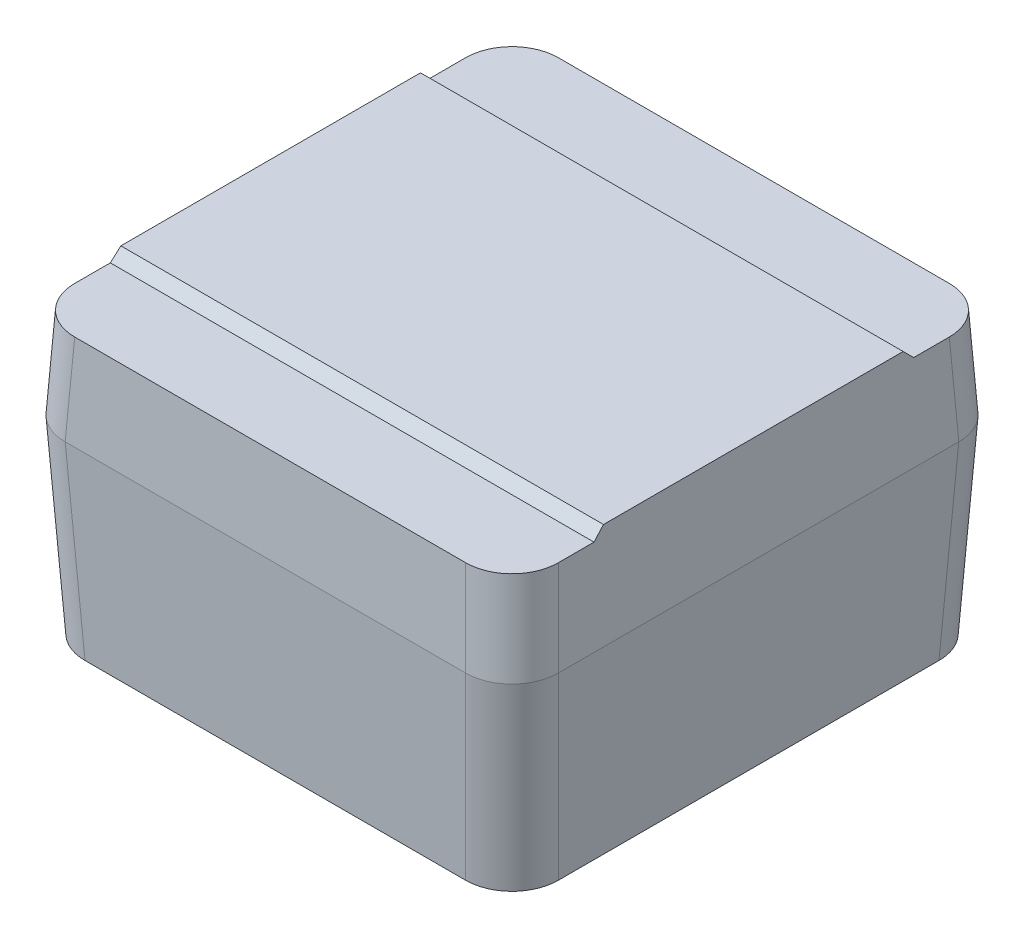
ISO-10303-21;
HEADER;
FILE_DESCRIPTION(('STEP AP214'),'2;1');
FILE_NAME('part.step','',(''),(''),'','','');
FILE_SCHEMA(('AUTOMOTIVE_DESIGN { 1 0 10303 214 1 1 1 1 }'));
ENDSEC;
DATA;
#1=APPLICATION_CONTEXT('core data for automotive mechanical design processes');
#2=APPLICATION_PROTOCOL_DEFINITION('international standard','automotive_design',2000,#1);
#3=PRODUCT_CONTEXT('',#1,'mechanical');
#4=PRODUCT('Part','Part','',(#3));
#5=PRODUCT_RELATED_PRODUCT_CATEGORY('part','',(#4));
#6=PRODUCT_DEFINITION_FORMATION('','',#4);
#7=PRODUCT_DEFINITION_CONTEXT('part definition',#1,'design');
#8=PRODUCT_DEFINITION('design','',#6,#7);
#9=PRODUCT_DEFINITION_SHAPE('','',#8);
#10=(LENGTH_UNIT() NAMED_UNIT(*) SI_UNIT(.MILLI.,.METRE.));
#11=(NAMED_UNIT(*) PLANE_ANGLE_UNIT() SI_UNIT($,.RADIAN.));
#12=(NAMED_UNIT(*) SI_UNIT($,.STERADIAN.) SOLID_ANGLE_UNIT());
#13=UNCERTAINTY_MEASURE_WITH_UNIT(LENGTH_MEASURE(1.E-05),#10,'distance_accuracy_value','');
#14=(GEOMETRIC_REPRESENTATION_CONTEXT(3) GLOBAL_UNCERTAINTY_ASSIGNED_CONTEXT((#13)) GLOBAL_UNIT_ASSIGNED_CONTEXT((#10,
#11,#12)) REPRESENTATION_CONTEXT('',''));
#15=CARTESIAN_POINT('',(0.,0.,0.));
#16=DIRECTION('',(0.,0.,1.));
#17=DIRECTION('',(1.,0.,0.));
#18=AXIS2_PLACEMENT_3D('',#15,#16,#17);
#19=CARTESIAN_POINT('',(4.3815,0.,-4.3815));
#20=DIRECTION('',(0.,0.0523359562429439,-0.998629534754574));
#21=DIRECTION('',(0.,0.998629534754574,0.0523359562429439));
#22=AXIS2_PLACEMENT_3D('',#19,#20,#21);
#23=PLANE('',#22);
#24=DIRECTION('',(1.,0.,0.));
#25=VECTOR('',#24,1.);
#26=CARTESIAN_POINT('',(4.3815,1.6129,-4.29697149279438));
#27=LINE('',#26,#25);
#28=CARTESIAN_POINT('',(3.47260281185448,1.6129,-4.29697149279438));
#29=VERTEX_POINT('',#28);
#30=CARTESIAN_POINT('',(-3.47260281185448,1.6129,-4.29697149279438));
#31=VERTEX_POINT('',#30);
#32=EDGE_CURVE('E165',#29,#31,#27,.F.);
#33=ORIENTED_EDGE('',*,*,#32,.F.);
#34=DIRECTION('',(-0.052264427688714,0.997264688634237,0.052264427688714));
#35=VECTOR('',#34,1.);
#36=CARTESIAN_POINT('',(3.55938314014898,-0.0429673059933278,-4.38375182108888));
#37=LINE('',#36,#35);
#38=CARTESIAN_POINT('',(3.5571313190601,0.,-4.3815));
#39=VERTEX_POINT('',#38);
#40=EDGE_CURVE('E252',#29,#39,#37,.F.);
#41=ORIENTED_EDGE('',*,*,#40,.T.);
#42=DIRECTION('',(-1.,0.,0.));
#43=VECTOR('',#42,1.);
#44=CARTESIAN_POINT('',(4.3815,0.,-4.3815));
#45=LINE('',#44,#43);
#46=CARTESIAN_POINT('',(-3.5571313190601,0.,-4.3815));
#47=VERTEX_POINT('',#46);
#48=EDGE_CURVE('E210',#39,#47,#45,.T.);
#49=ORIENTED_EDGE('',*,*,#48,.T.);
#50=DIRECTION('',(0.052264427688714,0.997264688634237,0.052264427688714));
#51=VECTOR('',#50,1.);
#52=CARTESIAN_POINT('',(-3.53544638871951,0.413773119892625,-4.35981506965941));
#53=LINE('',#52,#51);
#54=EDGE_CURVE('E249',#47,#31,#53,.T.);
#55=ORIENTED_EDGE('',*,*,#54,.T.);
#56=EDGE_LOOP('',(#33,#41,#49,#55));
#57=FACE_BOUND('',#56,.T.);
#58=ADVANCED_FACE('F33',(#57),#23,.T.);
#59=CARTESIAN_POINT('',(3.55938314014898,-0.086170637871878,-3.55938314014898));
#60=DIRECTION('',(0.052264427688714,-0.997264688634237,-0.052264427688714));
#61=DIRECTION('',(0.,0.0523359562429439,-0.998629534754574));
#62=AXIS2_PLACEMENT_3D('',#59,#60,#61);
#63=CYLINDRICAL_SURFACE('',#62,0.8255);
#64=ORIENTED_EDGE('',*,*,#40,.F.);
#65=CARTESIAN_POINT('',(3.4703386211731,1.6129,-3.4703386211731));
#66=DIRECTION('',(0.,1.,0.));
#67=DIRECTION('',(0.707106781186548,0.,-0.707106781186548));
#68=AXIS2_PLACEMENT_3D('',#65,#66,#67);
#69=ELLIPSE('',#68,0.82776419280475,0.8255);
#70=CARTESIAN_POINT('',(4.29697149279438,1.6129,-3.47260281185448));
#71=VERTEX_POINT('',#70);
#72=EDGE_CURVE('E182',#29,#71,#69,.F.);
#73=ORIENTED_EDGE('',*,*,#72,.T.);
#74=DIRECTION('',(-0.052264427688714,0.997264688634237,0.052264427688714));
#75=VECTOR('',#74,1.);
#76=CARTESIAN_POINT('',(4.35981506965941,0.413773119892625,-3.53544638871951));
#77=LINE('',#76,#75);
#78=CARTESIAN_POINT('',(4.3815,0.,-3.5571313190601));
#79=VERTEX_POINT('',#78);
#80=EDGE_CURVE('E234',#79,#71,#77,.T.);
#81=ORIENTED_EDGE('',*,*,#80,.F.);
#82=CARTESIAN_POINT('',(3.55486712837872,0.,-3.55486712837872));
#83=DIRECTION('',(0.,-1.,0.));
#84=DIRECTION('',(0.707106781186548,0.,-0.707106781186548));
#85=AXIS2_PLACEMENT_3D('',#82,#83,#84);
#86=ELLIPSE('',#85,0.82776419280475,0.8255);
#87=EDGE_CURVE('E266',#39,#79,#86,.T.);
#88=ORIENTED_EDGE('',*,*,#87,.F.);
#89=EDGE_LOOP('',(#64,#73,#81,#88));
#90=FACE_BOUND('',#89,.T.);
#91=ADVANCED_FACE('F291',(#90),#63,.T.);
#92=CARTESIAN_POINT('',(-3.53544638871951,0.370569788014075,-3.53544638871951));
#93=DIRECTION('',(-0.052264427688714,-0.997264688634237,-0.052264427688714));
#94=DIRECTION('',(0.998629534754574,-0.0523359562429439,0.));
#95=AXIS2_PLACEMENT_3D('',#92,#93,#94);
#96=CYLINDRICAL_SURFACE('',#95,0.8255);
#97=DIRECTION('',(0.052264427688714,0.997264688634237,0.052264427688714));
#98=VECTOR('',#97,1.);
#99=CARTESIAN_POINT('',(-4.35981506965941,0.413773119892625,-3.53544638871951));
#100=LINE('',#99,#98);
#101=CARTESIAN_POINT('',(-4.29697149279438,1.6129,-3.47260281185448));
#102=VERTEX_POINT('',#101);
#103=CARTESIAN_POINT('',(-4.3815,0.,-3.5571313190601));
#104=VERTEX_POINT('',#103);
#105=EDGE_CURVE('E262',#102,#104,#100,.F.);
#106=ORIENTED_EDGE('',*,*,#105,.F.);
#107=CARTESIAN_POINT('',(-3.4703386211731,1.6129,-3.4703386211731));
#108=DIRECTION('',(0.,1.,0.));
#109=DIRECTION('',(-0.707106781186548,0.,-0.707106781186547));
#110=AXIS2_PLACEMENT_3D('',#107,#108,#109);
#111=ELLIPSE('',#110,0.82776419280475,0.8255);
#112=EDGE_CURVE('E157',#102,#31,#111,.F.);
#113=ORIENTED_EDGE('',*,*,#112,.T.);
#114=ORIENTED_EDGE('',*,*,#54,.F.);
#115=CARTESIAN_POINT('',(-3.55486712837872,0.,-3.55486712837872));
#116=DIRECTION('',(0.,-1.,0.));
#117=DIRECTION('',(-0.707106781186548,0.,-0.707106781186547));
#118=AXIS2_PLACEMENT_3D('',#115,#116,#117);
#119=ELLIPSE('',#118,0.82776419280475,0.8255);
#120=EDGE_CURVE('E268',#104,#47,#119,.T.);
#121=ORIENTED_EDGE('',*,*,#120,.F.);
#122=EDGE_LOOP('',(#106,#113,#114,#121));
#123=FACE_BOUND('',#122,.T.);
#124=ADVANCED_FACE('F319',(#123),#96,.T.);
#125=CARTESIAN_POINT('',(-4.3815,0.,4.3815));
#126=DIRECTION('',(-0.998629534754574,0.0523359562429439,0.));
#127=DIRECTION('',(-0.0523359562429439,-0.998629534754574,0.));
#128=AXIS2_PLACEMENT_3D('',#125,#126,#127);
#129=PLANE('',#128);
#130=DIRECTION('',(0.,0.,-1.));
#131=VECTOR('',#130,1.);
#132=CARTESIAN_POINT('',(-4.28765338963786,1.7907,4.3815));
#133=LINE('',#132,#131);
#134=CARTESIAN_POINT('',(-4.28765338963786,1.7907,-2.66205338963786));
#135=VERTEX_POINT('',#134);
#136=CARTESIAN_POINT('',(-4.28765338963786,1.7907,2.66205338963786));
#137=VERTEX_POINT('',#136);
#138=EDGE_CURVE('E213',#135,#137,#133,.F.);
#139=ORIENTED_EDGE('',*,*,#138,.F.);
#140=DIRECTION('',(0.0370324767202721,0.706621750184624,0.706621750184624));
#141=VECTOR('',#140,1.);
#142=CARTESIAN_POINT('',(-4.28411187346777,1.8582761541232,-2.59447723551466));
#143=LINE('',#142,#141);
#144=CARTESIAN_POINT('',(-4.29697149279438,1.6129,-2.83985338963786));
#145=VERTEX_POINT('',#144);
#146=EDGE_CURVE('E11',#135,#145,#143,.F.);
#147=ORIENTED_EDGE('',*,*,#146,.T.);
#148=DIRECTION('',(0.,0.,-1.));
#149=VECTOR('',#148,1.);
#150=CARTESIAN_POINT('',(-4.29697149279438,1.6129,4.3815));
#151=LINE('',#150,#149);
#152=EDGE_CURVE('E179',#102,#145,#151,.F.);
#153=ORIENTED_EDGE('',*,*,#152,.F.);
#154=ORIENTED_EDGE('',*,*,#105,.T.);
#155=DIRECTION('',(0.,0.,1.));
#156=VECTOR('',#155,1.);
#157=CARTESIAN_POINT('',(-4.3815,0.,4.3815));
#158=LINE('',#157,#156);
#159=CARTESIAN_POINT('',(-4.3815,0.,3.5571313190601));
#160=VERTEX_POINT('',#159);
#161=EDGE_CURVE('E201',#104,#160,#158,.T.);
#162=ORIENTED_EDGE('',*,*,#161,.T.);
#163=DIRECTION('',(0.052264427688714,0.997264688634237,-0.052264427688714));
#164=VECTOR('',#163,1.);
#165=CARTESIAN_POINT('',(-4.38375182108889,-0.0429673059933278,3.55938314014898));
#166=LINE('',#165,#164);
#167=CARTESIAN_POINT('',(-4.29697149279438,1.6129,3.47260281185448));
#168=VERTEX_POINT('',#167);
#169=EDGE_CURVE('E259',#160,#168,#166,.T.);
#170=ORIENTED_EDGE('',*,*,#169,.T.);
#171=DIRECTION('',(0.,0.,1.));
#172=VECTOR('',#171,1.);
#173=CARTESIAN_POINT('',(-4.29697149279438,1.6129,4.3815));
#174=LINE('',#173,#172);
#175=CARTESIAN_POINT('',(-4.29697149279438,1.6129,2.83985338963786));
#176=VERTEX_POINT('',#175);
#177=EDGE_CURVE('E171',#168,#176,#174,.F.);
#178=ORIENTED_EDGE('',*,*,#177,.T.);
#179=DIRECTION('',(-0.0370324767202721,-0.706621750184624,0.706621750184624));
#180=VECTOR('',#179,1.);
#181=CARTESIAN_POINT('',(-4.28411187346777,1.8582761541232,2.59447723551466));
#182=LINE('',#181,#180);
#183=EDGE_CURVE('E41',#176,#137,#182,.F.);
#184=ORIENTED_EDGE('',*,*,#183,.T.);
#185=EDGE_LOOP('',(#139,#147,#153,#154,#162,#170,#178,#184));
#186=FACE_BOUND('',#185,.T.);
#187=ADVANCED_FACE('F279',(#186),#129,.T.);
#188=CARTESIAN_POINT('',(4.3815,0.,4.3815));
#189=DIRECTION('',(0.,0.0523359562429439,0.998629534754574));
#190=DIRECTION('',(0.,-0.998629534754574,0.0523359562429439));
#191=AXIS2_PLACEMENT_3D('',#188,#189,#190);
#192=PLANE('',#191);
#193=DIRECTION('',(-0.052264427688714,0.997264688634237,-0.052264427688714));
#194=VECTOR('',#193,1.);
#195=CARTESIAN_POINT('',(3.55938314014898,-0.0429673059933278,4.38375182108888));
#196=LINE('',#195,#194);
#197=CARTESIAN_POINT('',(3.5571313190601,0.,4.3815));
#198=VERTEX_POINT('',#197);
#199=CARTESIAN_POINT('',(3.47260281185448,1.6129,4.29697149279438));
#200=VERTEX_POINT('',#199);
#201=EDGE_CURVE('E241',#198,#200,#196,.T.);
#202=ORIENTED_EDGE('',*,*,#201,.T.);
#203=DIRECTION('',(1.,0.,0.));
#204=VECTOR('',#203,1.);
#205=CARTESIAN_POINT('',(4.3815,1.6129,4.29697149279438));
#206=LINE('',#205,#204);
#207=CARTESIAN_POINT('',(-3.47260281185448,1.6129,4.29697149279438));
#208=VERTEX_POINT('',#207);
#209=EDGE_CURVE('E167',#200,#208,#206,.F.);
#210=ORIENTED_EDGE('',*,*,#209,.T.);
#211=DIRECTION('',(0.052264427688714,0.997264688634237,-0.052264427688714));
#212=VECTOR('',#211,1.);
#213=CARTESIAN_POINT('',(-3.53544638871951,0.413773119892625,4.35981506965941));
#214=LINE('',#213,#212);
#215=CARTESIAN_POINT('',(-3.5571313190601,0.,4.3815));
#216=VERTEX_POINT('',#215);
#217=EDGE_CURVE('E239',#208,#216,#214,.F.);
#218=ORIENTED_EDGE('',*,*,#217,.T.);
#219=DIRECTION('',(1.,0.,0.));
#220=VECTOR('',#219,1.);
#221=CARTESIAN_POINT('',(4.3815,0.,4.3815));
#222=LINE('',#221,#220);
#223=EDGE_CURVE('E204',#216,#198,#222,.T.);
#224=ORIENTED_EDGE('',*,*,#223,.T.);
#225=EDGE_LOOP('',(#202,#210,#218,#224));
#226=FACE_BOUND('',#225,.T.);
#227=ADVANCED_FACE('F335',(#226),#192,.T.);
#228=CARTESIAN_POINT('',(4.3815,0.,4.3815));
#229=DIRECTION('',(0.998629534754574,0.0523359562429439,0.));
#230=DIRECTION('',(-0.0523359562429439,0.998629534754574,0.));
#231=AXIS2_PLACEMENT_3D('',#228,#229,#230);
#232=PLANE('',#231);
#233=DIRECTION('',(0.,0.,1.));
#234=VECTOR('',#233,1.);
#235=CARTESIAN_POINT('',(4.29697149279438,1.6129,4.3815));
#236=LINE('',#235,#234);
#237=CARTESIAN_POINT('',(4.29697149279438,1.6129,-2.83985338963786));
#238=VERTEX_POINT('',#237);
#239=EDGE_CURVE('E185',#238,#71,#236,.F.);
#240=ORIENTED_EDGE('',*,*,#239,.F.);
#241=DIRECTION('',(0.0370324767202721,-0.706621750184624,-0.706621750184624));
#242=VECTOR('',#241,1.);
#243=CARTESIAN_POINT('',(4.29804534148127,1.5924097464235,-2.86034364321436));
#244=LINE('',#243,#242);
#245=CARTESIAN_POINT('',(4.28765338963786,1.7907,-2.66205338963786));
#246=VERTEX_POINT('',#245);
#247=EDGE_CURVE('E156',#238,#246,#244,.F.);
#248=ORIENTED_EDGE('',*,*,#247,.T.);
#249=DIRECTION('',(0.,0.,1.));
#250=VECTOR('',#249,1.);
#251=CARTESIAN_POINT('',(4.28765338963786,1.7907,4.3815));
#252=LINE('',#251,#250);
#253=CARTESIAN_POINT('',(4.28765338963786,1.7907,2.66205338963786));
#254=VERTEX_POINT('',#253);
#255=EDGE_CURVE('E152',#254,#246,#252,.F.);
#256=ORIENTED_EDGE('',*,*,#255,.F.);
#257=DIRECTION('',(-0.0370324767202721,0.706621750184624,-0.706621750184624));
#258=VECTOR('',#257,1.);
#259=CARTESIAN_POINT('',(4.29804534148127,1.5924097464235,2.86034364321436));
#260=LINE('',#259,#258);
#261=CARTESIAN_POINT('',(4.29697149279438,1.6129,2.83985338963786));
#262=VERTEX_POINT('',#261);
#263=EDGE_CURVE('E146',#254,#262,#260,.F.);
#264=ORIENTED_EDGE('',*,*,#263,.T.);
#265=DIRECTION('',(0.,0.,-1.));
#266=VECTOR('',#265,1.);
#267=CARTESIAN_POINT('',(4.29697149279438,1.6129,4.3815));
#268=LINE('',#267,#266);
#269=CARTESIAN_POINT('',(4.29697149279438,1.6129,3.47260281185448));
#270=VERTEX_POINT('',#269);
#271=EDGE_CURVE('E150',#262,#270,#268,.F.);
#272=ORIENTED_EDGE('',*,*,#271,.T.);
#273=DIRECTION('',(-0.052264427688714,0.997264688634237,-0.052264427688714));
#274=VECTOR('',#273,1.);
#275=CARTESIAN_POINT('',(4.38375182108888,-0.0429673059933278,3.55938314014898));
#276=LINE('',#275,#274);
#277=CARTESIAN_POINT('',(4.3815,0.,3.5571313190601));
#278=VERTEX_POINT('',#277);
#279=EDGE_CURVE('E237',#270,#278,#276,.F.);
#280=ORIENTED_EDGE('',*,*,#279,.T.);
#281=DIRECTION('',(0.,0.,-1.));
#282=VECTOR('',#281,1.);
#283=CARTESIAN_POINT('',(4.3815,0.,4.3815));
#284=LINE('',#283,#282);
#285=EDGE_CURVE('E207',#278,#79,#284,.T.);
#286=ORIENTED_EDGE('',*,*,#285,.T.);
#287=ORIENTED_EDGE('',*,*,#80,.T.);
#288=EDGE_LOOP('',(#240,#248,#256,#264,#272,#280,#286,#287));
#289=FACE_BOUND('',#288,.T.);
#290=ADVANCED_FACE('F149',(#289),#232,.T.);
#291=CARTESIAN_POINT('',(0.,1.7907,0.));
#292=DIRECTION('',(0.,1.,0.));
#293=DIRECTION('',(0.,0.,1.));
#294=AXIS2_PLACEMENT_3D('',#291,#292,#293);
#295=PLANE('',#294);
#296=ORIENTED_EDGE('',*,*,#255,.T.);
#297=DIRECTION('',(-1.,0.,0.));
#298=VECTOR('',#297,1.);
#299=CARTESIAN_POINT('',(-4.28765338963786,1.7907,-2.66205338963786));
#300=LINE('',#299,#298);
#301=EDGE_CURVE('E54',#246,#135,#300,.T.);
#302=ORIENTED_EDGE('',*,*,#301,.T.);
#303=ORIENTED_EDGE('',*,*,#138,.T.);
#304=DIRECTION('',(1.,0.,0.));
#305=VECTOR('',#304,1.);
#306=CARTESIAN_POINT('',(4.28765338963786,1.7907,2.66205338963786));
#307=LINE('',#306,#305);
#308=EDGE_CURVE('E275',#137,#254,#307,.T.);
#309=ORIENTED_EDGE('',*,*,#308,.T.);
#310=EDGE_LOOP('',(#296,#302,#303,#309));
#311=FACE_BOUND('',#310,.T.);
#312=ADVANCED_FACE('F277',(#311),#295,.T.);
#313=CARTESIAN_POINT('',(-4.3815,0.,-4.3815));
#314=DIRECTION('',(-0.998629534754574,-0.0523359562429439,0.));
#315=DIRECTION('',(0.0523359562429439,-0.998629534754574,0.));
#316=AXIS2_PLACEMENT_3D('',#313,#314,#315);
#317=PLANE('',#316);
#318=ORIENTED_EDGE('',*,*,#161,.F.);
#319=DIRECTION('',(0.052264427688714,-0.997264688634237,0.052264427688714));
#320=VECTOR('',#319,1.);
#321=CARTESIAN_POINT('',(-4.38375182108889,0.0429673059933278,-3.55938314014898));
#322=LINE('',#321,#320);
#323=CARTESIAN_POINT('',(-4.20512161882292,-3.3655,-3.38075293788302));
#324=VERTEX_POINT('',#323);
#325=EDGE_CURVE('E257',#104,#324,#322,.T.);
#326=ORIENTED_EDGE('',*,*,#325,.T.);
#327=DIRECTION('',(0.,0.,1.));
#328=VECTOR('',#327,1.);
#329=CARTESIAN_POINT('',(-4.20512161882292,-3.3655,-4.3815));
#330=LINE('',#329,#328);
#331=CARTESIAN_POINT('',(-4.20512161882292,-3.3655,3.38075293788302));
#332=VERTEX_POINT('',#331);
#333=EDGE_CURVE('E188',#332,#324,#330,.F.);
#334=ORIENTED_EDGE('',*,*,#333,.F.);
#335=DIRECTION('',(0.052264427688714,-0.997264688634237,-0.052264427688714));
#336=VECTOR('',#335,1.);
#337=CARTESIAN_POINT('',(-4.35981506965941,-0.413773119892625,3.53544638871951));
#338=LINE('',#337,#336);
#339=EDGE_CURVE('E254',#332,#160,#338,.F.);
#340=ORIENTED_EDGE('',*,*,#339,.T.);
#341=EDGE_LOOP('',(#318,#326,#334,#340));
#342=FACE_BOUND('',#341,.T.);
#343=ADVANCED_FACE('F322',(#342),#317,.T.);
#344=CARTESIAN_POINT('',(4.3815,0.,-4.3815));
#345=DIRECTION('',(0.,-0.0523359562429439,-0.998629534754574));
#346=DIRECTION('',(0.,0.998629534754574,-0.0523359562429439));
#347=AXIS2_PLACEMENT_3D('',#344,#345,#346);
#348=PLANE('',#347);
#349=ORIENTED_EDGE('',*,*,#48,.F.);
#350=DIRECTION('',(-0.052264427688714,-0.997264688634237,0.052264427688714));
#351=VECTOR('',#350,1.);
#352=CARTESIAN_POINT('',(3.55938314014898,0.0429673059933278,-4.38375182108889));
#353=LINE('',#352,#351);
#354=CARTESIAN_POINT('',(3.38075293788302,-3.3655,-4.20512161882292));
#355=VERTEX_POINT('',#354);
#356=EDGE_CURVE('E247',#39,#355,#353,.T.);
#357=ORIENTED_EDGE('',*,*,#356,.T.);
#358=DIRECTION('',(-1.,0.,0.));
#359=VECTOR('',#358,1.);
#360=CARTESIAN_POINT('',(4.3815,-3.3655,-4.20512161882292));
#361=LINE('',#360,#359);
#362=CARTESIAN_POINT('',(-3.38075293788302,-3.3655,-4.20512161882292));
#363=VERTEX_POINT('',#362);
#364=EDGE_CURVE('E191',#363,#355,#361,.F.);
#365=ORIENTED_EDGE('',*,*,#364,.F.);
#366=DIRECTION('',(0.052264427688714,-0.997264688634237,0.052264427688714));
#367=VECTOR('',#366,1.);
#368=CARTESIAN_POINT('',(-3.53544638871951,-0.413773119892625,-4.35981506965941));
#369=LINE('',#368,#367);
#370=EDGE_CURVE('E244',#363,#47,#369,.F.);
#371=ORIENTED_EDGE('',*,*,#370,.T.);
#372=EDGE_LOOP('',(#349,#357,#365,#371));
#373=FACE_BOUND('',#372,.T.);
#374=ADVANCED_FACE('F304',(#373),#348,.T.);
#375=CARTESIAN_POINT('',(4.3815,0.,-4.3815));
#376=DIRECTION('',(0.998629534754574,-0.0523359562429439,0.));
#377=DIRECTION('',(0.0523359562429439,0.998629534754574,0.));
#378=AXIS2_PLACEMENT_3D('',#375,#376,#377);
#379=PLANE('',#378);
#380=ORIENTED_EDGE('',*,*,#285,.F.);
#381=DIRECTION('',(-0.052264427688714,-0.997264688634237,-0.052264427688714));
#382=VECTOR('',#381,1.);
#383=CARTESIAN_POINT('',(4.35981506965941,-0.413773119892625,3.53544638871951));
#384=LINE('',#383,#382);
#385=CARTESIAN_POINT('',(4.20512161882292,-3.3655,3.38075293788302));
#386=VERTEX_POINT('',#385);
#387=EDGE_CURVE('E224',#278,#386,#384,.T.);
#388=ORIENTED_EDGE('',*,*,#387,.T.);
#389=DIRECTION('',(0.,0.,-1.));
#390=VECTOR('',#389,1.);
#391=CARTESIAN_POINT('',(4.20512161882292,-3.3655,-4.3815));
#392=LINE('',#391,#390);
#393=CARTESIAN_POINT('',(4.20512161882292,-3.3655,-3.38075293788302));
#394=VERTEX_POINT('',#393);
#395=EDGE_CURVE('E195',#394,#386,#392,.F.);
#396=ORIENTED_EDGE('',*,*,#395,.F.);
#397=DIRECTION('',(-0.052264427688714,-0.997264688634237,0.052264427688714));
#398=VECTOR('',#397,1.);
#399=CARTESIAN_POINT('',(4.38375182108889,0.0429673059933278,-3.55938314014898));
#400=LINE('',#399,#398);
#401=EDGE_CURVE('E221',#394,#79,#400,.F.);
#402=ORIENTED_EDGE('',*,*,#401,.T.);
#403=EDGE_LOOP('',(#380,#388,#396,#402));
#404=FACE_BOUND('',#403,.T.);
#405=ADVANCED_FACE('F295',(#404),#379,.T.);
#406=CARTESIAN_POINT('',(4.3815,0.,4.3815));
#407=DIRECTION('',(0.,-0.0523359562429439,0.998629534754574));
#408=DIRECTION('',(0.,-0.998629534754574,-0.0523359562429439));
#409=AXIS2_PLACEMENT_3D('',#406,#407,#408);
#410=PLANE('',#409);
#411=DIRECTION('',(1.,0.,0.));
#412=VECTOR('',#411,1.);
#413=CARTESIAN_POINT('',(4.3815,-3.3655,4.20512161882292));
#414=LINE('',#413,#412);
#415=CARTESIAN_POINT('',(3.38075293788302,-3.3655,4.20512161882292));
#416=VERTEX_POINT('',#415);
#417=CARTESIAN_POINT('',(-3.38075293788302,-3.3655,4.20512161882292));
#418=VERTEX_POINT('',#417);
#419=EDGE_CURVE('E198',#416,#418,#414,.F.);
#420=ORIENTED_EDGE('',*,*,#419,.F.);
#421=DIRECTION('',(-0.052264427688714,-0.997264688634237,-0.052264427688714));
#422=VECTOR('',#421,1.);
#423=CARTESIAN_POINT('',(3.55938314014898,0.0429673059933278,4.38375182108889));
#424=LINE('',#423,#422);
#425=EDGE_CURVE('E218',#416,#198,#424,.F.);
#426=ORIENTED_EDGE('',*,*,#425,.T.);
#427=ORIENTED_EDGE('',*,*,#223,.F.);
#428=DIRECTION('',(0.052264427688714,-0.997264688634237,-0.052264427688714));
#429=VECTOR('',#428,1.);
#430=CARTESIAN_POINT('',(-3.53544638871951,-0.413773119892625,4.35981506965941));
#431=LINE('',#430,#429);
#432=EDGE_CURVE('E216',#216,#418,#431,.T.);
#433=ORIENTED_EDGE('',*,*,#432,.T.);
#434=EDGE_LOOP('',(#420,#426,#427,#433));
#435=FACE_BOUND('',#434,.T.);
#436=ADVANCED_FACE('F344',(#435),#410,.T.);
#437=CARTESIAN_POINT('',(0.,-3.3655,0.));
#438=DIRECTION('',(0.,-1.,0.));
#439=DIRECTION('',(0.,0.,-1.));
#440=AXIS2_PLACEMENT_3D('',#437,#438,#439);
#441=PLANE('',#440);
#442=ORIENTED_EDGE('',*,*,#395,.T.);
#443=CARTESIAN_POINT('',(3.37848874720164,-3.3655,3.37848874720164));
#444=DIRECTION('',(0.,-1.,0.));
#445=DIRECTION('',(0.707106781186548,0.,0.707106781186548));
#446=AXIS2_PLACEMENT_3D('',#443,#444,#445);
#447=ELLIPSE('',#446,0.82776419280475,0.8255);
#448=EDGE_CURVE('E232',#386,#416,#447,.T.);
#449=ORIENTED_EDGE('',*,*,#448,.T.);
#450=ORIENTED_EDGE('',*,*,#419,.T.);
#451=CARTESIAN_POINT('',(-3.37848874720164,-3.3655,3.37848874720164));
#452=DIRECTION('',(0.,-1.,0.));
#453=DIRECTION('',(-0.707106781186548,0.,0.707106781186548));
#454=AXIS2_PLACEMENT_3D('',#451,#452,#453);
#455=ELLIPSE('',#454,0.82776419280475,0.8255);
#456=EDGE_CURVE('E226',#418,#332,#455,.T.);
#457=ORIENTED_EDGE('',*,*,#456,.T.);
#458=ORIENTED_EDGE('',*,*,#333,.T.);
#459=CARTESIAN_POINT('',(-3.37848874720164,-3.3655,-3.37848874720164));
#460=DIRECTION('',(0.,-1.,0.));
#461=DIRECTION('',(-0.707106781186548,0.,-0.707106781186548));
#462=AXIS2_PLACEMENT_3D('',#459,#460,#461);
#463=ELLIPSE('',#462,0.82776419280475,0.8255);
#464=EDGE_CURVE('E228',#324,#363,#463,.T.);
#465=ORIENTED_EDGE('',*,*,#464,.T.);
#466=ORIENTED_EDGE('',*,*,#364,.T.);
#467=CARTESIAN_POINT('',(3.37848874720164,-3.3655,-3.37848874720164));
#468=DIRECTION('',(0.,-1.,0.));
#469=DIRECTION('',(0.707106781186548,0.,-0.707106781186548));
#470=AXIS2_PLACEMENT_3D('',#467,#468,#469);
#471=ELLIPSE('',#470,0.82776419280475,0.8255);
#472=EDGE_CURVE('E230',#355,#394,#471,.T.);
#473=ORIENTED_EDGE('',*,*,#472,.T.);
#474=EDGE_LOOP('',(#442,#449,#450,#457,#458,#465,#466,#473));
#475=FACE_BOUND('',#474,.T.);
#476=ADVANCED_FACE('F307',(#475),#441,.T.);
#477=CARTESIAN_POINT('',(3.55938314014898,-0.0861706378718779,3.55938314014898));
#478=DIRECTION('',(0.052264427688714,-0.997264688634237,0.052264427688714));
#479=DIRECTION('',(0.998629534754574,0.0523359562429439,0.));
#480=AXIS2_PLACEMENT_3D('',#477,#478,#479);
#481=CYLINDRICAL_SURFACE('',#480,0.8255);
#482=CARTESIAN_POINT('',(3.4703386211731,1.6129,3.4703386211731));
#483=DIRECTION('',(0.,-1.,0.));
#484=DIRECTION('',(0.707106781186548,0.,0.707106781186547));
#485=AXIS2_PLACEMENT_3D('',#482,#483,#484);
#486=ELLIPSE('',#485,0.82776419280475,0.8255);
#487=EDGE_CURVE('E164',#200,#270,#486,.F.);
#488=ORIENTED_EDGE('',*,*,#487,.F.);
#489=ORIENTED_EDGE('',*,*,#201,.F.);
#490=CARTESIAN_POINT('',(3.55486712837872,0.,3.55486712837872));
#491=DIRECTION('',(0.,-1.,0.));
#492=DIRECTION('',(0.707106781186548,0.,0.707106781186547));
#493=AXIS2_PLACEMENT_3D('',#490,#491,#492);
#494=ELLIPSE('',#493,0.82776419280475,0.8255);
#495=EDGE_CURVE('E192',#278,#198,#494,.T.);
#496=ORIENTED_EDGE('',*,*,#495,.F.);
#497=ORIENTED_EDGE('',*,*,#279,.F.);
#498=EDGE_LOOP('',(#488,#489,#496,#497));
#499=FACE_BOUND('',#498,.T.);
#500=ADVANCED_FACE('F340',(#499),#481,.T.);
#501=CARTESIAN_POINT('',(3.55938314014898,0.086170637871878,3.55938314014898));
#502=DIRECTION('',(0.052264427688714,0.997264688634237,0.052264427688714));
#503=DIRECTION('',(0.,-0.0523359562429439,0.998629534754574));
#504=AXIS2_PLACEMENT_3D('',#501,#502,#503);
#505=CYLINDRICAL_SURFACE('',#504,0.8255);
#506=ORIENTED_EDGE('',*,*,#448,.F.);
#507=ORIENTED_EDGE('',*,*,#387,.F.);
#508=ORIENTED_EDGE('',*,*,#495,.T.);
#509=ORIENTED_EDGE('',*,*,#425,.F.);
#510=EDGE_LOOP('',(#506,#507,#508,#509));
#511=FACE_BOUND('',#510,.T.);
#512=ADVANCED_FACE('F347',(#511),#505,.T.);
#513=CARTESIAN_POINT('',(3.55938314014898,0.086170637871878,-3.55938314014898));
#514=DIRECTION('',(0.052264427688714,0.997264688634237,-0.052264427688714));
#515=DIRECTION('',(0.,0.0523359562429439,0.998629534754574));
#516=AXIS2_PLACEMENT_3D('',#513,#514,#515);
#517=CYLINDRICAL_SURFACE('',#516,0.8255);
#518=ORIENTED_EDGE('',*,*,#472,.F.);
#519=ORIENTED_EDGE('',*,*,#356,.F.);
#520=ORIENTED_EDGE('',*,*,#87,.T.);
#521=ORIENTED_EDGE('',*,*,#401,.F.);
#522=EDGE_LOOP('',(#518,#519,#520,#521));
#523=FACE_BOUND('',#522,.T.);
#524=ADVANCED_FACE('F299',(#523),#517,.T.);
#525=CARTESIAN_POINT('',(-3.53544638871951,-0.370569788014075,-3.53544638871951));
#526=DIRECTION('',(-0.052264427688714,0.997264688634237,-0.052264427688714));
#527=DIRECTION('',(0.,0.0523359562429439,0.998629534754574));
#528=AXIS2_PLACEMENT_3D('',#525,#526,#527);
#529=CYLINDRICAL_SURFACE('',#528,0.8255);
#530=ORIENTED_EDGE('',*,*,#464,.F.);
#531=ORIENTED_EDGE('',*,*,#325,.F.);
#532=ORIENTED_EDGE('',*,*,#120,.T.);
#533=ORIENTED_EDGE('',*,*,#370,.F.);
#534=EDGE_LOOP('',(#530,#531,#532,#533));
#535=FACE_BOUND('',#534,.T.);
#536=ADVANCED_FACE('F312',(#535),#529,.T.);
#537=CARTESIAN_POINT('',(-3.53544638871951,0.370569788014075,3.53544638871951));
#538=DIRECTION('',(-0.052264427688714,-0.997264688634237,0.052264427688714));
#539=DIRECTION('',(0.,-0.0523359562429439,-0.998629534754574));
#540=AXIS2_PLACEMENT_3D('',#537,#538,#539);
#541=CYLINDRICAL_SURFACE('',#540,0.8255);
#542=CARTESIAN_POINT('',(-3.4703386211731,1.6129,3.4703386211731));
#543=DIRECTION('',(0.,-1.,0.));
#544=DIRECTION('',(-0.707106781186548,0.,0.707106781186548));
#545=AXIS2_PLACEMENT_3D('',#542,#543,#544);
#546=ELLIPSE('',#545,0.82776419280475,0.8255);
#547=EDGE_CURVE('E264',#168,#208,#546,.F.);
#548=ORIENTED_EDGE('',*,*,#547,.F.);
#549=ORIENTED_EDGE('',*,*,#169,.F.);
#550=CARTESIAN_POINT('',(-3.55486712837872,0.,3.55486712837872));
#551=DIRECTION('',(0.,-1.,0.));
#552=DIRECTION('',(-0.707106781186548,0.,0.707106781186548));
#553=AXIS2_PLACEMENT_3D('',#550,#551,#552);
#554=ELLIPSE('',#553,0.82776419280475,0.8255);
#555=EDGE_CURVE('E187',#216,#160,#554,.T.);
#556=ORIENTED_EDGE('',*,*,#555,.F.);
#557=ORIENTED_EDGE('',*,*,#217,.F.);
#558=EDGE_LOOP('',(#548,#549,#556,#557));
#559=FACE_BOUND('',#558,.T.);
#560=ADVANCED_FACE('F333',(#559),#541,.T.);
#561=CARTESIAN_POINT('',(-3.53544638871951,-0.370569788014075,3.53544638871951));
#562=DIRECTION('',(-0.052264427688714,0.997264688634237,0.052264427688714));
#563=DIRECTION('',(0.,-0.0523359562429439,0.998629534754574));
#564=AXIS2_PLACEMENT_3D('',#561,#562,#563);
#565=CYLINDRICAL_SURFACE('',#564,0.8255);
#566=ORIENTED_EDGE('',*,*,#456,.F.);
#567=ORIENTED_EDGE('',*,*,#432,.F.);
#568=ORIENTED_EDGE('',*,*,#555,.T.);
#569=ORIENTED_EDGE('',*,*,#339,.F.);
#570=EDGE_LOOP('',(#566,#567,#568,#569));
#571=FACE_BOUND('',#570,.T.);
#572=ADVANCED_FACE('F326',(#571),#565,.T.);
#573=CARTESIAN_POINT('',(0.,1.6129,0.));
#574=DIRECTION('',(0.,-1.,0.));
#575=DIRECTION('',(0.,0.,-1.));
#576=AXIS2_PLACEMENT_3D('',#573,#574,#575);
#577=PLANE('',#576);
#578=DIRECTION('',(-1.,0.,0.));
#579=VECTOR('',#578,1.);
#580=CARTESIAN_POINT('',(5.08,1.6129,2.83985338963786));
#581=LINE('',#580,#579);
#582=EDGE_CURVE('E162',#262,#176,#581,.T.);
#583=ORIENTED_EDGE('',*,*,#582,.T.);
#584=ORIENTED_EDGE('',*,*,#177,.F.);
#585=ORIENTED_EDGE('',*,*,#547,.T.);
#586=ORIENTED_EDGE('',*,*,#209,.F.);
#587=ORIENTED_EDGE('',*,*,#487,.T.);
#588=ORIENTED_EDGE('',*,*,#271,.F.);
#589=EDGE_LOOP('',(#583,#584,#585,#586,#587,#588));
#590=FACE_BOUND('',#589,.T.);
#591=ADVANCED_FACE('F161',(#590),#577,.F.);
#592=CARTESIAN_POINT('',(0.,1.6129,0.));
#593=DIRECTION('',(0.,1.,0.));
#594=DIRECTION('',(0.,0.,1.));
#595=AXIS2_PLACEMENT_3D('',#592,#593,#594);
#596=PLANE('',#595);
#597=ORIENTED_EDGE('',*,*,#239,.T.);
#598=ORIENTED_EDGE('',*,*,#72,.F.);
#599=ORIENTED_EDGE('',*,*,#32,.T.);
#600=ORIENTED_EDGE('',*,*,#112,.F.);
#601=ORIENTED_EDGE('',*,*,#152,.T.);
#602=DIRECTION('',(1.,0.,0.));
#603=VECTOR('',#602,1.);
#604=CARTESIAN_POINT('',(5.08,1.6129,-2.83985338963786));
#605=LINE('',#604,#603);
#606=EDGE_CURVE('E168',#145,#238,#605,.T.);
#607=ORIENTED_EDGE('',*,*,#606,.T.);
#608=EDGE_LOOP('',(#597,#598,#599,#600,#601,#607));
#609=FACE_BOUND('',#608,.T.);
#610=ADVANCED_FACE('F285',(#609),#596,.T.);
#611=CARTESIAN_POINT('',(5.08,1.6129,-2.83985338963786));
#612=DIRECTION('',(0.,0.707106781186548,-0.707106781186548));
#613=DIRECTION('',(-1.,0.,0.));
#614=AXIS2_PLACEMENT_3D('',#611,#612,#613);
#615=PLANE('',#614);
#616=ORIENTED_EDGE('',*,*,#146,.F.);
#617=ORIENTED_EDGE('',*,*,#301,.F.);
#618=ORIENTED_EDGE('',*,*,#247,.F.);
#619=ORIENTED_EDGE('',*,*,#606,.F.);
#620=EDGE_LOOP('',(#616,#617,#618,#619));
#621=FACE_BOUND('',#620,.T.);
#622=ADVANCED_FACE('F283',(#621),#615,.T.);
#623=CARTESIAN_POINT('',(5.08,1.6129,2.83985338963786));
#624=DIRECTION('',(0.,0.707106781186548,0.707106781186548));
#625=DIRECTION('',(1.,0.,0.));
#626=AXIS2_PLACEMENT_3D('',#623,#624,#625);
#627=PLANE('',#626);
#628=ORIENTED_EDGE('',*,*,#263,.F.);
#629=ORIENTED_EDGE('',*,*,#308,.F.);
#630=ORIENTED_EDGE('',*,*,#183,.F.);
#631=ORIENTED_EDGE('',*,*,#582,.F.);
#632=EDGE_LOOP('',(#628,#629,#630,#631));
#633=FACE_BOUND('',#632,.T.);
#634=ADVANCED_FACE('F35',(#633),#627,.T.);
#635=CLOSED_SHELL('',(#58,#91,#124,#187,#227,#290,#312,#343,#374,#405,#436,#476,#500,#512,#524,
#536,#560,#572,#591,#610,#622,#634));
#636=MANIFOLD_SOLID_BREP('B2',#635);
#637=ADVANCED_BREP_SHAPE_REPRESENTATION('',(#18,#636),#14);
#638=SHAPE_DEFINITION_REPRESENTATION(#9,#637);
ENDSEC;
END-ISO-10303-21;
